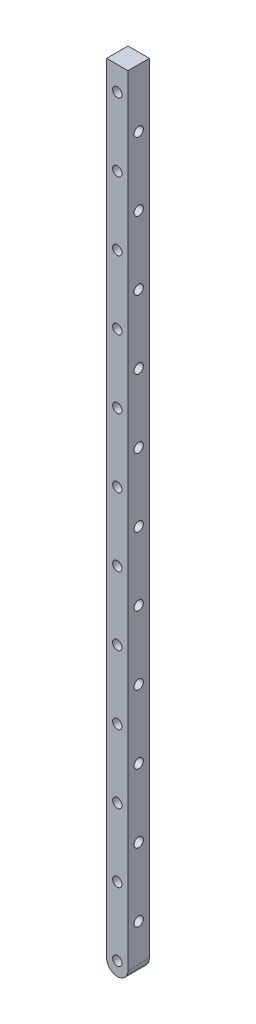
ISO-10303-21;
HEADER;
FILE_DESCRIPTION(('STEP AP214'),'2;1');
FILE_NAME('part.step','',(''),(''),'','','');
FILE_SCHEMA(('AUTOMOTIVE_DESIGN { 1 0 10303 214 1 1 1 1 }'));
ENDSEC;
DATA;
#1=APPLICATION_CONTEXT('core data for automotive mechanical design processes');
#2=APPLICATION_PROTOCOL_DEFINITION('international standard','automotive_design',2000,#1);
#3=PRODUCT_CONTEXT('',#1,'mechanical');
#4=PRODUCT('Part','Part','',(#3));
#5=PRODUCT_RELATED_PRODUCT_CATEGORY('part','',(#4));
#6=PRODUCT_DEFINITION_FORMATION('','',#4);
#7=PRODUCT_DEFINITION_CONTEXT('part definition',#1,'design');
#8=PRODUCT_DEFINITION('design','',#6,#7);
#9=PRODUCT_DEFINITION_SHAPE('','',#8);
#10=(LENGTH_UNIT() NAMED_UNIT(*) SI_UNIT(.MILLI.,.METRE.));
#11=(NAMED_UNIT(*) PLANE_ANGLE_UNIT() SI_UNIT($,.RADIAN.));
#12=(NAMED_UNIT(*) SI_UNIT($,.STERADIAN.) SOLID_ANGLE_UNIT());
#13=UNCERTAINTY_MEASURE_WITH_UNIT(LENGTH_MEASURE(1.E-05),#10,'distance_accuracy_value','');
#14=(GEOMETRIC_REPRESENTATION_CONTEXT(3) GLOBAL_UNCERTAINTY_ASSIGNED_CONTEXT((#13)) GLOBAL_UNIT_ASSIGNED_CONTEXT((#10,
#11,#12)) REPRESENTATION_CONTEXT('',''));
#15=CARTESIAN_POINT('',(0.,0.,0.));
#16=DIRECTION('',(0.,0.,1.));
#17=DIRECTION('',(1.,0.,0.));
#18=AXIS2_PLACEMENT_3D('',#15,#16,#17);
#19=CARTESIAN_POINT('',(0.,-289.40125,3.96874999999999));
#20=DIRECTION('',(0.,0.,1.));
#21=DIRECTION('',(1.,0.,0.));
#22=AXIS2_PLACEMENT_3D('',#19,#20,#21);
#23=CYLINDRICAL_SURFACE('',#22,3.96875000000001);
#24=DIRECTION('',(0.,0.,-1.));
#25=VECTOR('',#24,1.);
#26=CARTESIAN_POINT('',(3.96875,-289.40125,3.96874999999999));
#27=LINE('',#26,#25);
#28=CARTESIAN_POINT('',(3.96875,-289.40125,3.96874999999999));
#29=VERTEX_POINT('',#28);
#30=CARTESIAN_POINT('',(3.96875000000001,-289.40125,-3.96875000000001));
#31=VERTEX_POINT('',#30);
#32=EDGE_CURVE('E173',#29,#31,#27,.T.);
#33=ORIENTED_EDGE('',*,*,#32,.F.);
#34=CARTESIAN_POINT('',(0.,-289.40125,3.96874999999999));
#35=DIRECTION('',(0.,0.,-1.));
#36=DIRECTION('',(-1.,0.,0.));
#37=AXIS2_PLACEMENT_3D('',#34,#35,#36);
#38=CIRCLE('',#37,3.96875000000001);
#39=CARTESIAN_POINT('',(-3.96875,-289.40125,3.96874999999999));
#40=VERTEX_POINT('',#39);
#41=EDGE_CURVE('E46',#40,#29,#38,.F.);
#42=ORIENTED_EDGE('',*,*,#41,.F.);
#43=DIRECTION('',(0.,0.,-1.));
#44=VECTOR('',#43,1.);
#45=CARTESIAN_POINT('',(-3.96875,-289.40125,3.96874999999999));
#46=LINE('',#45,#44);
#47=CARTESIAN_POINT('',(-3.96874999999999,-289.40125,-3.96875000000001));
#48=VERTEX_POINT('',#47);
#49=EDGE_CURVE('E175',#48,#40,#46,.F.);
#50=ORIENTED_EDGE('',*,*,#49,.F.);
#51=CARTESIAN_POINT('',(0.,-289.40125,-3.96875000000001));
#52=DIRECTION('',(0.,0.,1.));
#53=DIRECTION('',(1.,0.,0.));
#54=AXIS2_PLACEMENT_3D('',#51,#52,#53);
#55=CIRCLE('',#54,3.96875000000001);
#56=EDGE_CURVE('E11',#31,#48,#55,.F.);
#57=ORIENTED_EDGE('',*,*,#56,.F.);
#58=EDGE_LOOP('',(#33,#42,#50,#57));
#59=FACE_BOUND('',#58,.T.);
#60=ADVANCED_FACE('F38',(#59),#23,.T.);
#61=CARTESIAN_POINT('',(-3.96875,-293.37,3.96874999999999));
#62=DIRECTION('',(1.,0.,0.));
#63=DIRECTION('',(0.,0.,-1.));
#64=AXIS2_PLACEMENT_3D('',#61,#62,#63);
#65=PLANE('',#64);
#66=CARTESIAN_POINT('',(-3.96874999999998,-275.59,0.));
#67=DIRECTION('',(-1.,0.,0.));
#68=DIRECTION('',(0.,0.,1.));
#69=AXIS2_PLACEMENT_3D('',#66,#67,#68);
#70=CIRCLE('',#69,1.72719999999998);
#71=CARTESIAN_POINT('',(-3.96874999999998,-275.59,1.72719999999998));
#72=VERTEX_POINT('',#71);
#73=EDGE_CURVE('E293',#72,#72,#70,.T.);
#74=ORIENTED_EDGE('',*,*,#73,.F.);
#75=EDGE_LOOP('',(#74));
#76=FACE_BOUND('',#75,.T.);
#77=CARTESIAN_POINT('',(-3.96874999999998,-21.59,0.));
#78=DIRECTION('',(-1.,0.,0.));
#79=DIRECTION('',(0.,0.,1.));
#80=AXIS2_PLACEMENT_3D('',#77,#78,#79);
#81=CIRCLE('',#80,1.72719999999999);
#82=CARTESIAN_POINT('',(-3.96874999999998,-21.59,1.72719999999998));
#83=VERTEX_POINT('',#82);
#84=EDGE_CURVE('E351',#83,#83,#81,.T.);
#85=ORIENTED_EDGE('',*,*,#84,.F.);
#86=EDGE_LOOP('',(#85));
#87=FACE_BOUND('',#86,.T.);
#88=DIRECTION('',(0.,1.,0.));
#89=VECTOR('',#88,1.);
#90=CARTESIAN_POINT('',(-3.96874999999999,-293.37,-3.96875000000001));
#91=LINE('',#90,#89);
#92=CARTESIAN_POINT('',(-3.96874999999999,0.,-3.96875000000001));
#93=VERTEX_POINT('',#92);
#94=EDGE_CURVE('E111',#48,#93,#91,.T.);
#95=ORIENTED_EDGE('',*,*,#94,.F.);
#96=ORIENTED_EDGE('',*,*,#49,.T.);
#97=DIRECTION('',(0.,1.,0.));
#98=VECTOR('',#97,1.);
#99=CARTESIAN_POINT('',(-3.96875,-293.37,3.96874999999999));
#100=LINE('',#99,#98);
#101=CARTESIAN_POINT('',(-3.96875,0.,3.96874999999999));
#102=VERTEX_POINT('',#101);
#103=EDGE_CURVE('E87',#40,#102,#100,.T.);
#104=ORIENTED_EDGE('',*,*,#103,.T.);
#105=DIRECTION('',(0.,0.,-1.));
#106=VECTOR('',#105,1.);
#107=CARTESIAN_POINT('',(-3.96875,0.,3.96874999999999));
#108=LINE('',#107,#106);
#109=EDGE_CURVE('E95',#102,#93,#108,.T.);
#110=ORIENTED_EDGE('',*,*,#109,.T.);
#111=EDGE_LOOP('',(#95,#96,#104,#110));
#112=FACE_BOUND('',#111,.T.);
#113=CARTESIAN_POINT('',(-3.96874999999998,-46.99,0.));
#114=DIRECTION('',(-1.,0.,0.));
#115=DIRECTION('',(0.,0.,1.));
#116=AXIS2_PLACEMENT_3D('',#113,#114,#115);
#117=CIRCLE('',#116,1.72719999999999);
#118=CARTESIAN_POINT('',(-3.96874999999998,-46.99,1.72719999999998));
#119=VERTEX_POINT('',#118);
#120=EDGE_CURVE('E345',#119,#119,#117,.T.);
#121=ORIENTED_EDGE('',*,*,#120,.F.);
#122=EDGE_LOOP('',(#121));
#123=FACE_BOUND('',#122,.T.);
#124=CARTESIAN_POINT('',(-3.96874999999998,-72.39,0.));
#125=DIRECTION('',(-1.,0.,0.));
#126=DIRECTION('',(0.,0.,1.));
#127=AXIS2_PLACEMENT_3D('',#124,#125,#126);
#128=CIRCLE('',#127,1.72719999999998);
#129=CARTESIAN_POINT('',(-3.96874999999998,-72.39,1.72719999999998));
#130=VERTEX_POINT('',#129);
#131=EDGE_CURVE('E339',#130,#130,#128,.T.);
#132=ORIENTED_EDGE('',*,*,#131,.F.);
#133=EDGE_LOOP('',(#132));
#134=FACE_BOUND('',#133,.T.);
#135=CARTESIAN_POINT('',(-3.96874999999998,-97.79,0.));
#136=DIRECTION('',(-1.,0.,0.));
#137=DIRECTION('',(0.,0.,1.));
#138=AXIS2_PLACEMENT_3D('',#135,#136,#137);
#139=CIRCLE('',#138,1.72719999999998);
#140=CARTESIAN_POINT('',(-3.96874999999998,-97.79,1.72719999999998));
#141=VERTEX_POINT('',#140);
#142=EDGE_CURVE('E333',#141,#141,#139,.T.);
#143=ORIENTED_EDGE('',*,*,#142,.F.);
#144=EDGE_LOOP('',(#143));
#145=FACE_BOUND('',#144,.T.);
#146=CARTESIAN_POINT('',(-3.96874999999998,-123.19,0.));
#147=DIRECTION('',(-1.,0.,0.));
#148=DIRECTION('',(0.,0.,1.));
#149=AXIS2_PLACEMENT_3D('',#146,#147,#148);
#150=CIRCLE('',#149,1.72719999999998);
#151=CARTESIAN_POINT('',(-3.96874999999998,-123.19,1.72719999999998));
#152=VERTEX_POINT('',#151);
#153=EDGE_CURVE('E327',#152,#152,#150,.T.);
#154=ORIENTED_EDGE('',*,*,#153,.F.);
#155=EDGE_LOOP('',(#154));
#156=FACE_BOUND('',#155,.T.);
#157=CARTESIAN_POINT('',(-3.96874999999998,-148.59,0.));
#158=DIRECTION('',(-1.,0.,0.));
#159=DIRECTION('',(0.,0.,1.));
#160=AXIS2_PLACEMENT_3D('',#157,#158,#159);
#161=CIRCLE('',#160,1.72719999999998);
#162=CARTESIAN_POINT('',(-3.96874999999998,-148.59,1.72719999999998));
#163=VERTEX_POINT('',#162);
#164=EDGE_CURVE('E321',#163,#163,#161,.T.);
#165=ORIENTED_EDGE('',*,*,#164,.F.);
#166=EDGE_LOOP('',(#165));
#167=FACE_BOUND('',#166,.T.);
#168=CARTESIAN_POINT('',(-3.96874999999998,-173.99,0.));
#169=DIRECTION('',(-1.,0.,0.));
#170=DIRECTION('',(0.,0.,1.));
#171=AXIS2_PLACEMENT_3D('',#168,#169,#170);
#172=CIRCLE('',#171,1.72719999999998);
#173=CARTESIAN_POINT('',(-3.96874999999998,-173.99,1.72719999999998));
#174=VERTEX_POINT('',#173);
#175=EDGE_CURVE('E315',#174,#174,#172,.T.);
#176=ORIENTED_EDGE('',*,*,#175,.F.);
#177=EDGE_LOOP('',(#176));
#178=FACE_BOUND('',#177,.T.);
#179=CARTESIAN_POINT('',(-3.96874999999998,-199.39,0.));
#180=DIRECTION('',(-1.,0.,0.));
#181=DIRECTION('',(0.,0.,1.));
#182=AXIS2_PLACEMENT_3D('',#179,#180,#181);
#183=CIRCLE('',#182,1.72719999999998);
#184=CARTESIAN_POINT('',(-3.96874999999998,-199.39,1.72719999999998));
#185=VERTEX_POINT('',#184);
#186=EDGE_CURVE('E309',#185,#185,#183,.T.);
#187=ORIENTED_EDGE('',*,*,#186,.F.);
#188=EDGE_LOOP('',(#187));
#189=FACE_BOUND('',#188,.T.);
#190=CARTESIAN_POINT('',(-3.96874999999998,-224.79,0.));
#191=DIRECTION('',(-1.,0.,0.));
#192=DIRECTION('',(0.,0.,1.));
#193=AXIS2_PLACEMENT_3D('',#190,#191,#192);
#194=CIRCLE('',#193,1.72719999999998);
#195=CARTESIAN_POINT('',(-3.96874999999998,-224.79,1.72719999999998));
#196=VERTEX_POINT('',#195);
#197=EDGE_CURVE('E303',#196,#196,#194,.T.);
#198=ORIENTED_EDGE('',*,*,#197,.F.);
#199=EDGE_LOOP('',(#198));
#200=FACE_BOUND('',#199,.T.);
#201=CARTESIAN_POINT('',(-3.96874999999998,-250.19,0.));
#202=DIRECTION('',(-1.,0.,0.));
#203=DIRECTION('',(0.,0.,1.));
#204=AXIS2_PLACEMENT_3D('',#201,#202,#203);
#205=CIRCLE('',#204,1.72719999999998);
#206=CARTESIAN_POINT('',(-3.96874999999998,-250.19,1.72719999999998));
#207=VERTEX_POINT('',#206);
#208=EDGE_CURVE('E295',#207,#207,#205,.T.);
#209=ORIENTED_EDGE('',*,*,#208,.F.);
#210=EDGE_LOOP('',(#209));
#211=FACE_BOUND('',#210,.T.);
#212=ADVANCED_FACE('F178',(#76,#87,#112,#123,#134,#145,#156,#167,#178,#189,#200,#211),#65,.F.);
#213=CARTESIAN_POINT('',(3.96875,-293.37,3.96874999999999));
#214=DIRECTION('',(-1.,0.,0.));
#215=DIRECTION('',(0.,0.,1.));
#216=AXIS2_PLACEMENT_3D('',#213,#214,#215);
#217=PLANE('',#216);
#218=CARTESIAN_POINT('',(3.96875000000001,-275.59,0.));
#219=DIRECTION('',(-1.,0.,0.));
#220=DIRECTION('',(0.,0.,1.));
#221=AXIS2_PLACEMENT_3D('',#218,#219,#220);
#222=CIRCLE('',#221,1.72719999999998);
#223=CARTESIAN_POINT('',(3.96875000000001,-275.59,1.72719999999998));
#224=VERTEX_POINT('',#223);
#225=EDGE_CURVE('E291',#224,#224,#222,.T.);
#226=ORIENTED_EDGE('',*,*,#225,.T.);
#227=EDGE_LOOP('',(#226));
#228=FACE_BOUND('',#227,.T.);
#229=CARTESIAN_POINT('',(3.96875000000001,-250.19,0.));
#230=DIRECTION('',(-1.,0.,0.));
#231=DIRECTION('',(0.,0.,1.));
#232=AXIS2_PLACEMENT_3D('',#229,#230,#231);
#233=CIRCLE('',#232,1.72719999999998);
#234=CARTESIAN_POINT('',(3.96875000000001,-250.19,1.72719999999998));
#235=VERTEX_POINT('',#234);
#236=EDGE_CURVE('E300',#235,#235,#233,.T.);
#237=ORIENTED_EDGE('',*,*,#236,.T.);
#238=EDGE_LOOP('',(#237));
#239=FACE_BOUND('',#238,.T.);
#240=CARTESIAN_POINT('',(3.96875000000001,-224.79,0.));
#241=DIRECTION('',(-1.,0.,0.));
#242=DIRECTION('',(0.,0.,1.));
#243=AXIS2_PLACEMENT_3D('',#240,#241,#242);
#244=CIRCLE('',#243,1.72719999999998);
#245=CARTESIAN_POINT('',(3.96875000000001,-224.79,1.72719999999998));
#246=VERTEX_POINT('',#245);
#247=EDGE_CURVE('E306',#246,#246,#244,.T.);
#248=ORIENTED_EDGE('',*,*,#247,.T.);
#249=EDGE_LOOP('',(#248));
#250=FACE_BOUND('',#249,.T.);
#251=CARTESIAN_POINT('',(3.96875000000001,-199.39,0.));
#252=DIRECTION('',(-1.,0.,0.));
#253=DIRECTION('',(0.,0.,1.));
#254=AXIS2_PLACEMENT_3D('',#251,#252,#253);
#255=CIRCLE('',#254,1.72720000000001);
#256=CARTESIAN_POINT('',(3.96875000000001,-199.39,1.7272));
#257=VERTEX_POINT('',#256);
#258=EDGE_CURVE('E312',#257,#257,#255,.T.);
#259=ORIENTED_EDGE('',*,*,#258,.T.);
#260=EDGE_LOOP('',(#259));
#261=FACE_BOUND('',#260,.T.);
#262=CARTESIAN_POINT('',(3.96875000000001,-173.99,0.));
#263=DIRECTION('',(-1.,0.,0.));
#264=DIRECTION('',(0.,0.,1.));
#265=AXIS2_PLACEMENT_3D('',#262,#263,#264);
#266=CIRCLE('',#265,1.72719999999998);
#267=CARTESIAN_POINT('',(3.96875000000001,-173.99,1.72719999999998));
#268=VERTEX_POINT('',#267);
#269=EDGE_CURVE('E318',#268,#268,#266,.T.);
#270=ORIENTED_EDGE('',*,*,#269,.T.);
#271=EDGE_LOOP('',(#270));
#272=FACE_BOUND('',#271,.T.);
#273=CARTESIAN_POINT('',(3.96875000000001,-148.59,0.));
#274=DIRECTION('',(-1.,0.,0.));
#275=DIRECTION('',(0.,0.,1.));
#276=AXIS2_PLACEMENT_3D('',#273,#274,#275);
#277=CIRCLE('',#276,1.72719999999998);
#278=CARTESIAN_POINT('',(3.96875000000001,-148.59,1.72719999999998));
#279=VERTEX_POINT('',#278);
#280=EDGE_CURVE('E324',#279,#279,#277,.T.);
#281=ORIENTED_EDGE('',*,*,#280,.T.);
#282=EDGE_LOOP('',(#281));
#283=FACE_BOUND('',#282,.T.);
#284=CARTESIAN_POINT('',(3.96875000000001,-123.19,0.));
#285=DIRECTION('',(-1.,0.,0.));
#286=DIRECTION('',(0.,0.,1.));
#287=AXIS2_PLACEMENT_3D('',#284,#285,#286);
#288=CIRCLE('',#287,1.7272);
#289=CARTESIAN_POINT('',(3.96875000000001,-123.19,1.72719999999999));
#290=VERTEX_POINT('',#289);
#291=EDGE_CURVE('E330',#290,#290,#288,.T.);
#292=ORIENTED_EDGE('',*,*,#291,.T.);
#293=EDGE_LOOP('',(#292));
#294=FACE_BOUND('',#293,.T.);
#295=CARTESIAN_POINT('',(3.96875000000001,-97.79,0.));
#296=DIRECTION('',(-1.,0.,0.));
#297=DIRECTION('',(0.,0.,1.));
#298=AXIS2_PLACEMENT_3D('',#295,#296,#297);
#299=CIRCLE('',#298,1.7272);
#300=CARTESIAN_POINT('',(3.96875000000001,-97.79,1.72719999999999));
#301=VERTEX_POINT('',#300);
#302=EDGE_CURVE('E336',#301,#301,#299,.T.);
#303=ORIENTED_EDGE('',*,*,#302,.T.);
#304=EDGE_LOOP('',(#303));
#305=FACE_BOUND('',#304,.T.);
#306=CARTESIAN_POINT('',(3.96875000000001,-72.39,0.));
#307=DIRECTION('',(-1.,0.,0.));
#308=DIRECTION('',(0.,0.,1.));
#309=AXIS2_PLACEMENT_3D('',#306,#307,#308);
#310=CIRCLE('',#309,1.7272);
#311=CARTESIAN_POINT('',(3.96875000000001,-72.39,1.72719999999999));
#312=VERTEX_POINT('',#311);
#313=EDGE_CURVE('E342',#312,#312,#310,.T.);
#314=ORIENTED_EDGE('',*,*,#313,.T.);
#315=EDGE_LOOP('',(#314));
#316=FACE_BOUND('',#315,.T.);
#317=CARTESIAN_POINT('',(3.96875000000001,-46.99,0.));
#318=DIRECTION('',(-1.,0.,0.));
#319=DIRECTION('',(0.,0.,1.));
#320=AXIS2_PLACEMENT_3D('',#317,#318,#319);
#321=CIRCLE('',#320,1.7272);
#322=CARTESIAN_POINT('',(3.96875000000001,-46.99,1.72719999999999));
#323=VERTEX_POINT('',#322);
#324=EDGE_CURVE('E348',#323,#323,#321,.T.);
#325=ORIENTED_EDGE('',*,*,#324,.T.);
#326=EDGE_LOOP('',(#325));
#327=FACE_BOUND('',#326,.T.);
#328=CARTESIAN_POINT('',(3.96875000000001,-21.59,0.));
#329=DIRECTION('',(-1.,0.,0.));
#330=DIRECTION('',(0.,0.,1.));
#331=AXIS2_PLACEMENT_3D('',#328,#329,#330);
#332=CIRCLE('',#331,1.7272);
#333=CARTESIAN_POINT('',(3.96875000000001,-21.59,1.72719999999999));
#334=VERTEX_POINT('',#333);
#335=EDGE_CURVE('E354',#334,#334,#332,.T.);
#336=ORIENTED_EDGE('',*,*,#335,.T.);
#337=EDGE_LOOP('',(#336));
#338=FACE_BOUND('',#337,.T.);
#339=DIRECTION('',(0.,1.,0.));
#340=VECTOR('',#339,1.);
#341=CARTESIAN_POINT('',(3.96875,-293.37,3.96874999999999));
#342=LINE('',#341,#340);
#343=CARTESIAN_POINT('',(3.96875,0.,3.96874999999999));
#344=VERTEX_POINT('',#343);
#345=EDGE_CURVE('E76',#29,#344,#342,.T.);
#346=ORIENTED_EDGE('',*,*,#345,.F.);
#347=ORIENTED_EDGE('',*,*,#32,.T.);
#348=DIRECTION('',(0.,1.,0.));
#349=VECTOR('',#348,1.);
#350=CARTESIAN_POINT('',(3.96875000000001,-293.37,-3.96875000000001));
#351=LINE('',#350,#349);
#352=CARTESIAN_POINT('',(3.96875000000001,0.,-3.96875000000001));
#353=VERTEX_POINT('',#352);
#354=EDGE_CURVE('E98',#31,#353,#351,.T.);
#355=ORIENTED_EDGE('',*,*,#354,.T.);
#356=DIRECTION('',(0.,0.,1.));
#357=VECTOR('',#356,1.);
#358=CARTESIAN_POINT('',(3.96875,0.,3.96874999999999));
#359=LINE('',#358,#357);
#360=EDGE_CURVE('E93',#353,#344,#359,.T.);
#361=ORIENTED_EDGE('',*,*,#360,.T.);
#362=EDGE_LOOP('',(#346,#347,#355,#361));
#363=FACE_BOUND('',#362,.T.);
#364=ADVANCED_FACE('F97',(#228,#239,#250,#261,#272,#283,#294,#305,#316,#327,#338,#363),#217,.F.);
#365=CARTESIAN_POINT('',(-3.96875,-293.37,3.96874999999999));
#366=DIRECTION('',(0.,0.,-1.));
#367=DIRECTION('',(-1.,0.,0.));
#368=AXIS2_PLACEMENT_3D('',#365,#366,#367);
#369=PLANE('',#368);
#370=CARTESIAN_POINT('',(0.,-34.29,3.96874999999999));
#371=DIRECTION('',(0.,0.,1.));
#372=DIRECTION('',(1.,0.,0.));
#373=AXIS2_PLACEMENT_3D('',#370,#371,#372);
#374=CIRCLE('',#373,1.72719999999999);
#375=CARTESIAN_POINT('',(1.72719999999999,-34.29,3.96874999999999));
#376=VERTEX_POINT('',#375);
#377=EDGE_CURVE('E360',#376,#376,#374,.T.);
#378=ORIENTED_EDGE('',*,*,#377,.F.);
#379=EDGE_LOOP('',(#378));
#380=FACE_BOUND('',#379,.T.);
#381=CARTESIAN_POINT('',(0.,-8.89,3.96874999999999));
#382=DIRECTION('',(0.,0.,1.));
#383=DIRECTION('',(1.,0.,0.));
#384=AXIS2_PLACEMENT_3D('',#381,#382,#383);
#385=CIRCLE('',#384,1.72719999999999);
#386=CARTESIAN_POINT('',(1.72719999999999,-8.89,3.96874999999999));
#387=VERTEX_POINT('',#386);
#388=EDGE_CURVE('E103',#387,#387,#385,.T.);
#389=ORIENTED_EDGE('',*,*,#388,.F.);
#390=EDGE_LOOP('',(#389));
#391=FACE_BOUND('',#390,.T.);
#392=ORIENTED_EDGE('',*,*,#103,.F.);
#393=ORIENTED_EDGE('',*,*,#41,.T.);
#394=ORIENTED_EDGE('',*,*,#345,.T.);
#395=DIRECTION('',(-1.,0.,0.));
#396=VECTOR('',#395,1.);
#397=CARTESIAN_POINT('',(-3.96875,0.,3.96874999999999));
#398=LINE('',#397,#396);
#399=EDGE_CURVE('E81',#344,#102,#398,.T.);
#400=ORIENTED_EDGE('',*,*,#399,.T.);
#401=EDGE_LOOP('',(#392,#393,#394,#400));
#402=FACE_BOUND('',#401,.T.);
#403=CARTESIAN_POINT('',(0.,-59.69,3.96874999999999));
#404=DIRECTION('',(0.,0.,1.));
#405=DIRECTION('',(1.,0.,0.));
#406=AXIS2_PLACEMENT_3D('',#403,#404,#405);
#407=CIRCLE('',#406,1.72719999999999);
#408=CARTESIAN_POINT('',(1.72719999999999,-59.69,3.96874999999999));
#409=VERTEX_POINT('',#408);
#410=EDGE_CURVE('E116',#409,#409,#407,.T.);
#411=ORIENTED_EDGE('',*,*,#410,.F.);
#412=EDGE_LOOP('',(#411));
#413=FACE_BOUND('',#412,.T.);
#414=CARTESIAN_POINT('',(0.,-85.09,3.96874999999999));
#415=DIRECTION('',(0.,0.,1.));
#416=DIRECTION('',(1.,0.,0.));
#417=AXIS2_PLACEMENT_3D('',#414,#415,#416);
#418=CIRCLE('',#417,1.72719999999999);
#419=CARTESIAN_POINT('',(1.72719999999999,-85.09,3.96874999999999));
#420=VERTEX_POINT('',#419);
#421=EDGE_CURVE('E122',#420,#420,#418,.T.);
#422=ORIENTED_EDGE('',*,*,#421,.F.);
#423=EDGE_LOOP('',(#422));
#424=FACE_BOUND('',#423,.T.);
#425=CARTESIAN_POINT('',(0.,-110.49,3.96874999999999));
#426=DIRECTION('',(0.,0.,1.));
#427=DIRECTION('',(1.,0.,0.));
#428=AXIS2_PLACEMENT_3D('',#425,#426,#427);
#429=CIRCLE('',#428,1.72719999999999);
#430=CARTESIAN_POINT('',(1.72719999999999,-110.49,3.96874999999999));
#431=VERTEX_POINT('',#430);
#432=EDGE_CURVE('E128',#431,#431,#429,.T.);
#433=ORIENTED_EDGE('',*,*,#432,.F.);
#434=EDGE_LOOP('',(#433));
#435=FACE_BOUND('',#434,.T.);
#436=CARTESIAN_POINT('',(0.,-135.89,3.96874999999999));
#437=DIRECTION('',(0.,0.,1.));
#438=DIRECTION('',(1.,0.,0.));
#439=AXIS2_PLACEMENT_3D('',#436,#437,#438);
#440=CIRCLE('',#439,1.72719999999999);
#441=CARTESIAN_POINT('',(1.72719999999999,-135.89,3.96874999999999));
#442=VERTEX_POINT('',#441);
#443=EDGE_CURVE('E134',#442,#442,#440,.T.);
#444=ORIENTED_EDGE('',*,*,#443,.F.);
#445=EDGE_LOOP('',(#444));
#446=FACE_BOUND('',#445,.T.);
#447=CARTESIAN_POINT('',(0.,-161.29,3.96874999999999));
#448=DIRECTION('',(0.,0.,1.));
#449=DIRECTION('',(1.,0.,0.));
#450=AXIS2_PLACEMENT_3D('',#447,#448,#449);
#451=CIRCLE('',#450,1.72719999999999);
#452=CARTESIAN_POINT('',(1.72719999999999,-161.29,3.96874999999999));
#453=VERTEX_POINT('',#452);
#454=EDGE_CURVE('E140',#453,#453,#451,.T.);
#455=ORIENTED_EDGE('',*,*,#454,.F.);
#456=EDGE_LOOP('',(#455));
#457=FACE_BOUND('',#456,.T.);
#458=CARTESIAN_POINT('',(0.,-186.69,3.96874999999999));
#459=DIRECTION('',(0.,0.,1.));
#460=DIRECTION('',(1.,0.,0.));
#461=AXIS2_PLACEMENT_3D('',#458,#459,#460);
#462=CIRCLE('',#461,1.72719999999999);
#463=CARTESIAN_POINT('',(1.72719999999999,-186.69,3.96874999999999));
#464=VERTEX_POINT('',#463);
#465=EDGE_CURVE('E146',#464,#464,#462,.T.);
#466=ORIENTED_EDGE('',*,*,#465,.F.);
#467=EDGE_LOOP('',(#466));
#468=FACE_BOUND('',#467,.T.);
#469=CARTESIAN_POINT('',(0.,-212.09,3.96874999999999));
#470=DIRECTION('',(0.,0.,1.));
#471=DIRECTION('',(1.,0.,0.));
#472=AXIS2_PLACEMENT_3D('',#469,#470,#471);
#473=CIRCLE('',#472,1.72719999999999);
#474=CARTESIAN_POINT('',(1.72719999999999,-212.09,3.96874999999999));
#475=VERTEX_POINT('',#474);
#476=EDGE_CURVE('E152',#475,#475,#473,.T.);
#477=ORIENTED_EDGE('',*,*,#476,.F.);
#478=EDGE_LOOP('',(#477));
#479=FACE_BOUND('',#478,.T.);
#480=CARTESIAN_POINT('',(0.,-237.49,3.96874999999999));
#481=DIRECTION('',(0.,0.,1.));
#482=DIRECTION('',(1.,0.,0.));
#483=AXIS2_PLACEMENT_3D('',#480,#481,#482);
#484=CIRCLE('',#483,1.72719999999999);
#485=CARTESIAN_POINT('',(1.72719999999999,-237.49,3.96874999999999));
#486=VERTEX_POINT('',#485);
#487=EDGE_CURVE('E158',#486,#486,#484,.T.);
#488=ORIENTED_EDGE('',*,*,#487,.F.);
#489=EDGE_LOOP('',(#488));
#490=FACE_BOUND('',#489,.T.);
#491=CARTESIAN_POINT('',(0.,-262.89,3.96874999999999));
#492=DIRECTION('',(0.,0.,1.));
#493=DIRECTION('',(1.,0.,0.));
#494=AXIS2_PLACEMENT_3D('',#491,#492,#493);
#495=CIRCLE('',#494,1.72719999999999);
#496=CARTESIAN_POINT('',(1.72719999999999,-262.89,3.96874999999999));
#497=VERTEX_POINT('',#496);
#498=EDGE_CURVE('E164',#497,#497,#495,.T.);
#499=ORIENTED_EDGE('',*,*,#498,.F.);
#500=EDGE_LOOP('',(#499));
#501=FACE_BOUND('',#500,.T.);
#502=CARTESIAN_POINT('',(0.,-288.29,3.96874999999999));
#503=DIRECTION('',(0.,0.,1.));
#504=DIRECTION('',(1.,0.,0.));
#505=AXIS2_PLACEMENT_3D('',#502,#503,#504);
#506=CIRCLE('',#505,1.72719999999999);
#507=CARTESIAN_POINT('',(1.72719999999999,-288.29,3.96874999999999));
#508=VERTEX_POINT('',#507);
#509=EDGE_CURVE('E170',#508,#508,#506,.T.);
#510=ORIENTED_EDGE('',*,*,#509,.F.);
#511=EDGE_LOOP('',(#510));
#512=FACE_BOUND('',#511,.T.);
#513=ADVANCED_FACE('F79',(#380,#391,#402,#413,#424,#435,#446,#457,#468,#479,#490,#501,#512),
#369,.F.);
#514=CARTESIAN_POINT('',(-3.96874999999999,-293.37,-3.96875000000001));
#515=DIRECTION('',(0.,0.,1.));
#516=DIRECTION('',(1.,0.,0.));
#517=AXIS2_PLACEMENT_3D('',#514,#515,#516);
#518=PLANE('',#517);
#519=CARTESIAN_POINT('',(0.,-34.29,-3.96875000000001));
#520=DIRECTION('',(0.,0.,1.));
#521=DIRECTION('',(1.,0.,0.));
#522=AXIS2_PLACEMENT_3D('',#519,#520,#521);
#523=CIRCLE('',#522,1.7272);
#524=CARTESIAN_POINT('',(1.7272,-34.29,-3.96875000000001));
#525=VERTEX_POINT('',#524);
#526=EDGE_CURVE('E357',#525,#525,#523,.T.);
#527=ORIENTED_EDGE('',*,*,#526,.T.);
#528=EDGE_LOOP('',(#527));
#529=FACE_BOUND('',#528,.T.);
#530=CARTESIAN_POINT('',(0.,-8.89,-3.96875000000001));
#531=DIRECTION('',(0.,0.,1.));
#532=DIRECTION('',(1.,0.,0.));
#533=AXIS2_PLACEMENT_3D('',#530,#531,#532);
#534=CIRCLE('',#533,1.7272);
#535=CARTESIAN_POINT('',(1.7272,-8.89,-3.96875000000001));
#536=VERTEX_POINT('',#535);
#537=EDGE_CURVE('E100',#536,#536,#534,.T.);
#538=ORIENTED_EDGE('',*,*,#537,.T.);
#539=EDGE_LOOP('',(#538));
#540=FACE_BOUND('',#539,.T.);
#541=ORIENTED_EDGE('',*,*,#354,.F.);
#542=ORIENTED_EDGE('',*,*,#56,.T.);
#543=ORIENTED_EDGE('',*,*,#94,.T.);
#544=DIRECTION('',(1.,0.,0.));
#545=VECTOR('',#544,1.);
#546=CARTESIAN_POINT('',(-3.96874999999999,0.,-3.96875000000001));
#547=LINE('',#546,#545);
#548=EDGE_CURVE('E108',#93,#353,#547,.T.);
#549=ORIENTED_EDGE('',*,*,#548,.T.);
#550=EDGE_LOOP('',(#541,#542,#543,#549));
#551=FACE_BOUND('',#550,.T.);
#552=CARTESIAN_POINT('',(0.,-59.69,-3.96875000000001));
#553=DIRECTION('',(0.,0.,1.));
#554=DIRECTION('',(1.,0.,0.));
#555=AXIS2_PLACEMENT_3D('',#552,#553,#554);
#556=CIRCLE('',#555,1.7272);
#557=CARTESIAN_POINT('',(1.7272,-59.69,-3.96875000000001));
#558=VERTEX_POINT('',#557);
#559=EDGE_CURVE('E86',#558,#558,#556,.T.);
#560=ORIENTED_EDGE('',*,*,#559,.T.);
#561=EDGE_LOOP('',(#560));
#562=FACE_BOUND('',#561,.T.);
#563=CARTESIAN_POINT('',(0.,-85.09,-3.96875000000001));
#564=DIRECTION('',(0.,0.,1.));
#565=DIRECTION('',(1.,0.,0.));
#566=AXIS2_PLACEMENT_3D('',#563,#564,#565);
#567=CIRCLE('',#566,1.7272);
#568=CARTESIAN_POINT('',(1.7272,-85.09,-3.96875000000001));
#569=VERTEX_POINT('',#568);
#570=EDGE_CURVE('E119',#569,#569,#567,.T.);
#571=ORIENTED_EDGE('',*,*,#570,.T.);
#572=EDGE_LOOP('',(#571));
#573=FACE_BOUND('',#572,.T.);
#574=CARTESIAN_POINT('',(0.,-110.49,-3.96875000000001));
#575=DIRECTION('',(0.,0.,1.));
#576=DIRECTION('',(1.,0.,0.));
#577=AXIS2_PLACEMENT_3D('',#574,#575,#576);
#578=CIRCLE('',#577,1.7272);
#579=CARTESIAN_POINT('',(1.7272,-110.49,-3.96875000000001));
#580=VERTEX_POINT('',#579);
#581=EDGE_CURVE('E125',#580,#580,#578,.T.);
#582=ORIENTED_EDGE('',*,*,#581,.T.);
#583=EDGE_LOOP('',(#582));
#584=FACE_BOUND('',#583,.T.);
#585=CARTESIAN_POINT('',(0.,-135.89,-3.96875000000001));
#586=DIRECTION('',(0.,0.,1.));
#587=DIRECTION('',(1.,0.,0.));
#588=AXIS2_PLACEMENT_3D('',#585,#586,#587);
#589=CIRCLE('',#588,1.7272);
#590=CARTESIAN_POINT('',(1.7272,-135.89,-3.96875000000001));
#591=VERTEX_POINT('',#590);
#592=EDGE_CURVE('E131',#591,#591,#589,.T.);
#593=ORIENTED_EDGE('',*,*,#592,.T.);
#594=EDGE_LOOP('',(#593));
#595=FACE_BOUND('',#594,.T.);
#596=CARTESIAN_POINT('',(0.,-161.29,-3.96875000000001));
#597=DIRECTION('',(0.,0.,1.));
#598=DIRECTION('',(1.,0.,0.));
#599=AXIS2_PLACEMENT_3D('',#596,#597,#598);
#600=CIRCLE('',#599,1.7272);
#601=CARTESIAN_POINT('',(1.7272,-161.29,-3.96875000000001));
#602=VERTEX_POINT('',#601);
#603=EDGE_CURVE('E137',#602,#602,#600,.T.);
#604=ORIENTED_EDGE('',*,*,#603,.T.);
#605=EDGE_LOOP('',(#604));
#606=FACE_BOUND('',#605,.T.);
#607=CARTESIAN_POINT('',(0.,-186.69,-3.96875000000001));
#608=DIRECTION('',(0.,0.,1.));
#609=DIRECTION('',(1.,0.,0.));
#610=AXIS2_PLACEMENT_3D('',#607,#608,#609);
#611=CIRCLE('',#610,1.7272);
#612=CARTESIAN_POINT('',(1.7272,-186.69,-3.96875000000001));
#613=VERTEX_POINT('',#612);
#614=EDGE_CURVE('E143',#613,#613,#611,.T.);
#615=ORIENTED_EDGE('',*,*,#614,.T.);
#616=EDGE_LOOP('',(#615));
#617=FACE_BOUND('',#616,.T.);
#618=CARTESIAN_POINT('',(0.,-212.09,-3.96875000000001));
#619=DIRECTION('',(0.,0.,1.));
#620=DIRECTION('',(1.,0.,0.));
#621=AXIS2_PLACEMENT_3D('',#618,#619,#620);
#622=CIRCLE('',#621,1.7272);
#623=CARTESIAN_POINT('',(1.7272,-212.09,-3.96875000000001));
#624=VERTEX_POINT('',#623);
#625=EDGE_CURVE('E149',#624,#624,#622,.T.);
#626=ORIENTED_EDGE('',*,*,#625,.T.);
#627=EDGE_LOOP('',(#626));
#628=FACE_BOUND('',#627,.T.);
#629=CARTESIAN_POINT('',(0.,-237.49,-3.96875000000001));
#630=DIRECTION('',(0.,0.,1.));
#631=DIRECTION('',(1.,0.,0.));
#632=AXIS2_PLACEMENT_3D('',#629,#630,#631);
#633=CIRCLE('',#632,1.7272);
#634=CARTESIAN_POINT('',(1.7272,-237.49,-3.96875000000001));
#635=VERTEX_POINT('',#634);
#636=EDGE_CURVE('E155',#635,#635,#633,.T.);
#637=ORIENTED_EDGE('',*,*,#636,.T.);
#638=EDGE_LOOP('',(#637));
#639=FACE_BOUND('',#638,.T.);
#640=CARTESIAN_POINT('',(0.,-262.89,-3.96875000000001));
#641=DIRECTION('',(0.,0.,1.));
#642=DIRECTION('',(1.,0.,0.));
#643=AXIS2_PLACEMENT_3D('',#640,#641,#642);
#644=CIRCLE('',#643,1.7272);
#645=CARTESIAN_POINT('',(1.7272,-262.89,-3.96875000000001));
#646=VERTEX_POINT('',#645);
#647=EDGE_CURVE('E161',#646,#646,#644,.T.);
#648=ORIENTED_EDGE('',*,*,#647,.T.);
#649=EDGE_LOOP('',(#648));
#650=FACE_BOUND('',#649,.T.);
#651=CARTESIAN_POINT('',(0.,-288.29,-3.96875000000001));
#652=DIRECTION('',(0.,0.,1.));
#653=DIRECTION('',(1.,0.,0.));
#654=AXIS2_PLACEMENT_3D('',#651,#652,#653);
#655=CIRCLE('',#654,1.7272);
#656=CARTESIAN_POINT('',(1.7272,-288.29,-3.96875000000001));
#657=VERTEX_POINT('',#656);
#658=EDGE_CURVE('E167',#657,#657,#655,.T.);
#659=ORIENTED_EDGE('',*,*,#658,.T.);
#660=EDGE_LOOP('',(#659));
#661=FACE_BOUND('',#660,.T.);
#662=ADVANCED_FACE('F180',(#529,#540,#551,#562,#573,#584,#595,#606,#617,#628,#639,#650,#661),
#518,.F.);
#663=CARTESIAN_POINT('',(0.,0.,0.));
#664=DIRECTION('',(0.,-1.,0.));
#665=DIRECTION('',(0.,0.,-1.));
#666=AXIS2_PLACEMENT_3D('',#663,#664,#665);
#667=PLANE('',#666);
#668=ORIENTED_EDGE('',*,*,#360,.F.);
#669=ORIENTED_EDGE('',*,*,#548,.F.);
#670=ORIENTED_EDGE('',*,*,#109,.F.);
#671=ORIENTED_EDGE('',*,*,#399,.F.);
#672=EDGE_LOOP('',(#668,#669,#670,#671));
#673=FACE_BOUND('',#672,.T.);
#674=ADVANCED_FACE('F91',(#673),#667,.F.);
#675=CARTESIAN_POINT('',(0.,-8.89,3.96874999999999));
#676=DIRECTION('',(0.,0.,1.));
#677=DIRECTION('',(1.,0.,0.));
#678=AXIS2_PLACEMENT_3D('',#675,#676,#677);
#679=CYLINDRICAL_SURFACE('',#678,1.72719999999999);
#680=ORIENTED_EDGE('',*,*,#537,.F.);
#681=EDGE_LOOP('',(#680));
#682=FACE_BOUND('',#681,.T.);
#683=ORIENTED_EDGE('',*,*,#388,.T.);
#684=EDGE_LOOP('',(#683));
#685=FACE_BOUND('',#684,.T.);
#686=ADVANCED_FACE('F235',(#682,#685),#679,.F.);
#687=CARTESIAN_POINT('',(0.,-34.29,3.96874999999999));
#688=DIRECTION('',(0.,0.,1.));
#689=DIRECTION('',(1.,0.,0.));
#690=AXIS2_PLACEMENT_3D('',#687,#688,#689);
#691=CYLINDRICAL_SURFACE('',#690,1.72719999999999);
#692=ORIENTED_EDGE('',*,*,#526,.F.);
#693=EDGE_LOOP('',(#692));
#694=FACE_BOUND('',#693,.T.);
#695=ORIENTED_EDGE('',*,*,#377,.T.);
#696=EDGE_LOOP('',(#695));
#697=FACE_BOUND('',#696,.T.);
#698=ADVANCED_FACE('F238',(#694,#697),#691,.F.);
#699=CARTESIAN_POINT('',(0.,-59.69,3.96874999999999));
#700=DIRECTION('',(0.,0.,1.));
#701=DIRECTION('',(1.,0.,0.));
#702=AXIS2_PLACEMENT_3D('',#699,#700,#701);
#703=CYLINDRICAL_SURFACE('',#702,1.72719999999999);
#704=ORIENTED_EDGE('',*,*,#559,.F.);
#705=EDGE_LOOP('',(#704));
#706=FACE_BOUND('',#705,.T.);
#707=ORIENTED_EDGE('',*,*,#410,.T.);
#708=EDGE_LOOP('',(#707));
#709=FACE_BOUND('',#708,.T.);
#710=ADVANCED_FACE('F242',(#706,#709),#703,.F.);
#711=CARTESIAN_POINT('',(0.,-85.09,3.96874999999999));
#712=DIRECTION('',(0.,0.,1.));
#713=DIRECTION('',(1.,0.,0.));
#714=AXIS2_PLACEMENT_3D('',#711,#712,#713);
#715=CYLINDRICAL_SURFACE('',#714,1.72719999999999);
#716=ORIENTED_EDGE('',*,*,#570,.F.);
#717=EDGE_LOOP('',(#716));
#718=FACE_BOUND('',#717,.T.);
#719=ORIENTED_EDGE('',*,*,#421,.T.);
#720=EDGE_LOOP('',(#719));
#721=FACE_BOUND('',#720,.T.);
#722=ADVANCED_FACE('F519',(#718,#721),#715,.F.);
#723=CARTESIAN_POINT('',(0.,-110.49,3.96874999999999));
#724=DIRECTION('',(0.,0.,1.));
#725=DIRECTION('',(1.,0.,0.));
#726=AXIS2_PLACEMENT_3D('',#723,#724,#725);
#727=CYLINDRICAL_SURFACE('',#726,1.72719999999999);
#728=ORIENTED_EDGE('',*,*,#581,.F.);
#729=EDGE_LOOP('',(#728));
#730=FACE_BOUND('',#729,.T.);
#731=ORIENTED_EDGE('',*,*,#432,.T.);
#732=EDGE_LOOP('',(#731));
#733=FACE_BOUND('',#732,.T.);
#734=ADVANCED_FACE('F512',(#730,#733),#727,.F.);
#735=CARTESIAN_POINT('',(0.,-135.89,3.96874999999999));
#736=DIRECTION('',(0.,0.,1.));
#737=DIRECTION('',(1.,0.,0.));
#738=AXIS2_PLACEMENT_3D('',#735,#736,#737);
#739=CYLINDRICAL_SURFACE('',#738,1.72719999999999);
#740=ORIENTED_EDGE('',*,*,#592,.F.);
#741=EDGE_LOOP('',(#740));
#742=FACE_BOUND('',#741,.T.);
#743=ORIENTED_EDGE('',*,*,#443,.T.);
#744=EDGE_LOOP('',(#743));
#745=FACE_BOUND('',#744,.T.);
#746=ADVANCED_FACE('F505',(#742,#745),#739,.F.);
#747=CARTESIAN_POINT('',(0.,-161.29,3.96874999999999));
#748=DIRECTION('',(0.,0.,1.));
#749=DIRECTION('',(1.,0.,0.));
#750=AXIS2_PLACEMENT_3D('',#747,#748,#749);
#751=CYLINDRICAL_SURFACE('',#750,1.72719999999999);
#752=ORIENTED_EDGE('',*,*,#603,.F.);
#753=EDGE_LOOP('',(#752));
#754=FACE_BOUND('',#753,.T.);
#755=ORIENTED_EDGE('',*,*,#454,.T.);
#756=EDGE_LOOP('',(#755));
#757=FACE_BOUND('',#756,.T.);
#758=ADVANCED_FACE('F498',(#754,#757),#751,.F.);
#759=CARTESIAN_POINT('',(0.,-186.69,3.96874999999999));
#760=DIRECTION('',(0.,0.,1.));
#761=DIRECTION('',(1.,0.,0.));
#762=AXIS2_PLACEMENT_3D('',#759,#760,#761);
#763=CYLINDRICAL_SURFACE('',#762,1.72719999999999);
#764=ORIENTED_EDGE('',*,*,#614,.F.);
#765=EDGE_LOOP('',(#764));
#766=FACE_BOUND('',#765,.T.);
#767=ORIENTED_EDGE('',*,*,#465,.T.);
#768=EDGE_LOOP('',(#767));
#769=FACE_BOUND('',#768,.T.);
#770=ADVANCED_FACE('F491',(#766,#769),#763,.F.);
#771=CARTESIAN_POINT('',(0.,-212.09,3.96874999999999));
#772=DIRECTION('',(0.,0.,1.));
#773=DIRECTION('',(1.,0.,0.));
#774=AXIS2_PLACEMENT_3D('',#771,#772,#773);
#775=CYLINDRICAL_SURFACE('',#774,1.72719999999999);
#776=ORIENTED_EDGE('',*,*,#625,.F.);
#777=EDGE_LOOP('',(#776));
#778=FACE_BOUND('',#777,.T.);
#779=ORIENTED_EDGE('',*,*,#476,.T.);
#780=EDGE_LOOP('',(#779));
#781=FACE_BOUND('',#780,.T.);
#782=ADVANCED_FACE('F481',(#778,#781),#775,.F.);
#783=CARTESIAN_POINT('',(0.,-237.49,3.96874999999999));
#784=DIRECTION('',(0.,0.,1.));
#785=DIRECTION('',(1.,0.,0.));
#786=AXIS2_PLACEMENT_3D('',#783,#784,#785);
#787=CYLINDRICAL_SURFACE('',#786,1.72719999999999);
#788=ORIENTED_EDGE('',*,*,#636,.F.);
#789=EDGE_LOOP('',(#788));
#790=FACE_BOUND('',#789,.T.);
#791=ORIENTED_EDGE('',*,*,#487,.T.);
#792=EDGE_LOOP('',(#791));
#793=FACE_BOUND('',#792,.T.);
#794=ADVANCED_FACE('F472',(#790,#793),#787,.F.);
#795=CARTESIAN_POINT('',(0.,-262.89,3.96874999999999));
#796=DIRECTION('',(0.,0.,1.));
#797=DIRECTION('',(1.,0.,0.));
#798=AXIS2_PLACEMENT_3D('',#795,#796,#797);
#799=CYLINDRICAL_SURFACE('',#798,1.72719999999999);
#800=ORIENTED_EDGE('',*,*,#647,.F.);
#801=EDGE_LOOP('',(#800));
#802=FACE_BOUND('',#801,.T.);
#803=ORIENTED_EDGE('',*,*,#498,.T.);
#804=EDGE_LOOP('',(#803));
#805=FACE_BOUND('',#804,.T.);
#806=ADVANCED_FACE('F209',(#802,#805),#799,.F.);
#807=CARTESIAN_POINT('',(0.,-288.29,3.96874999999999));
#808=DIRECTION('',(0.,0.,1.));
#809=DIRECTION('',(1.,0.,0.));
#810=AXIS2_PLACEMENT_3D('',#807,#808,#809);
#811=CYLINDRICAL_SURFACE('',#810,1.72719999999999);
#812=ORIENTED_EDGE('',*,*,#658,.F.);
#813=EDGE_LOOP('',(#812));
#814=FACE_BOUND('',#813,.T.);
#815=ORIENTED_EDGE('',*,*,#509,.T.);
#816=EDGE_LOOP('',(#815));
#817=FACE_BOUND('',#816,.T.);
#818=ADVANCED_FACE('F205',(#814,#817),#811,.F.);
#819=CARTESIAN_POINT('',(-3.96874999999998,-21.59,0.));
#820=DIRECTION('',(-1.,0.,0.));
#821=DIRECTION('',(0.,0.,1.));
#822=AXIS2_PLACEMENT_3D('',#819,#820,#821);
#823=CYLINDRICAL_SURFACE('',#822,1.72719999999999);
#824=ORIENTED_EDGE('',*,*,#335,.F.);
#825=EDGE_LOOP('',(#824));
#826=FACE_BOUND('',#825,.T.);
#827=ORIENTED_EDGE('',*,*,#84,.T.);
#828=EDGE_LOOP('',(#827));
#829=FACE_BOUND('',#828,.T.);
#830=ADVANCED_FACE('F208',(#826,#829),#823,.F.);
#831=CARTESIAN_POINT('',(-3.96874999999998,-46.99,0.));
#832=DIRECTION('',(-1.,0.,0.));
#833=DIRECTION('',(0.,0.,1.));
#834=AXIS2_PLACEMENT_3D('',#831,#832,#833);
#835=CYLINDRICAL_SURFACE('',#834,1.72719999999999);
#836=ORIENTED_EDGE('',*,*,#324,.F.);
#837=EDGE_LOOP('',(#836));
#838=FACE_BOUND('',#837,.T.);
#839=ORIENTED_EDGE('',*,*,#120,.T.);
#840=EDGE_LOOP('',(#839));
#841=FACE_BOUND('',#840,.T.);
#842=ADVANCED_FACE('F246',(#838,#841),#835,.F.);
#843=CARTESIAN_POINT('',(-3.96874999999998,-72.39,0.));
#844=DIRECTION('',(-1.,0.,0.));
#845=DIRECTION('',(0.,0.,1.));
#846=AXIS2_PLACEMENT_3D('',#843,#844,#845);
#847=CYLINDRICAL_SURFACE('',#846,1.72719999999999);
#848=ORIENTED_EDGE('',*,*,#313,.F.);
#849=EDGE_LOOP('',(#848));
#850=FACE_BOUND('',#849,.T.);
#851=ORIENTED_EDGE('',*,*,#131,.T.);
#852=EDGE_LOOP('',(#851));
#853=FACE_BOUND('',#852,.T.);
#854=ADVANCED_FACE('F250',(#850,#853),#847,.F.);
#855=CARTESIAN_POINT('',(-3.96874999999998,-97.79,0.));
#856=DIRECTION('',(-1.,0.,0.));
#857=DIRECTION('',(0.,0.,1.));
#858=AXIS2_PLACEMENT_3D('',#855,#856,#857);
#859=CYLINDRICAL_SURFACE('',#858,1.72719999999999);
#860=ORIENTED_EDGE('',*,*,#302,.F.);
#861=EDGE_LOOP('',(#860));
#862=FACE_BOUND('',#861,.T.);
#863=ORIENTED_EDGE('',*,*,#142,.T.);
#864=EDGE_LOOP('',(#863));
#865=FACE_BOUND('',#864,.T.);
#866=ADVANCED_FACE('F254',(#862,#865),#859,.F.);
#867=CARTESIAN_POINT('',(-3.96874999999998,-123.19,0.));
#868=DIRECTION('',(-1.,0.,0.));
#869=DIRECTION('',(0.,0.,1.));
#870=AXIS2_PLACEMENT_3D('',#867,#868,#869);
#871=CYLINDRICAL_SURFACE('',#870,1.72719999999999);
#872=ORIENTED_EDGE('',*,*,#291,.F.);
#873=EDGE_LOOP('',(#872));
#874=FACE_BOUND('',#873,.T.);
#875=ORIENTED_EDGE('',*,*,#153,.T.);
#876=EDGE_LOOP('',(#875));
#877=FACE_BOUND('',#876,.T.);
#878=ADVANCED_FACE('F258',(#874,#877),#871,.F.);
#879=CARTESIAN_POINT('',(-3.96874999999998,-148.59,0.));
#880=DIRECTION('',(-1.,0.,0.));
#881=DIRECTION('',(0.,0.,1.));
#882=AXIS2_PLACEMENT_3D('',#879,#880,#881);
#883=CYLINDRICAL_SURFACE('',#882,1.72719999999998);
#884=ORIENTED_EDGE('',*,*,#280,.F.);
#885=EDGE_LOOP('',(#884));
#886=FACE_BOUND('',#885,.T.);
#887=ORIENTED_EDGE('',*,*,#164,.T.);
#888=EDGE_LOOP('',(#887));
#889=FACE_BOUND('',#888,.T.);
#890=ADVANCED_FACE('F262',(#886,#889),#883,.F.);
#891=CARTESIAN_POINT('',(-3.96874999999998,-173.99,0.));
#892=DIRECTION('',(-1.,0.,0.));
#893=DIRECTION('',(0.,0.,1.));
#894=AXIS2_PLACEMENT_3D('',#891,#892,#893);
#895=CYLINDRICAL_SURFACE('',#894,1.72719999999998);
#896=ORIENTED_EDGE('',*,*,#269,.F.);
#897=EDGE_LOOP('',(#896));
#898=FACE_BOUND('',#897,.T.);
#899=ORIENTED_EDGE('',*,*,#175,.T.);
#900=EDGE_LOOP('',(#899));
#901=FACE_BOUND('',#900,.T.);
#902=ADVANCED_FACE('F266',(#898,#901),#895,.F.);
#903=CARTESIAN_POINT('',(-3.96874999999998,-199.39,0.));
#904=DIRECTION('',(-1.,0.,0.));
#905=DIRECTION('',(0.,0.,1.));
#906=AXIS2_PLACEMENT_3D('',#903,#904,#905);
#907=CYLINDRICAL_SURFACE('',#906,1.7272);
#908=ORIENTED_EDGE('',*,*,#258,.F.);
#909=EDGE_LOOP('',(#908));
#910=FACE_BOUND('',#909,.T.);
#911=ORIENTED_EDGE('',*,*,#186,.T.);
#912=EDGE_LOOP('',(#911));
#913=FACE_BOUND('',#912,.T.);
#914=ADVANCED_FACE('F270',(#910,#913),#907,.F.);
#915=CARTESIAN_POINT('',(-3.96874999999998,-224.79,0.));
#916=DIRECTION('',(-1.,0.,0.));
#917=DIRECTION('',(0.,0.,1.));
#918=AXIS2_PLACEMENT_3D('',#915,#916,#917);
#919=CYLINDRICAL_SURFACE('',#918,1.72719999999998);
#920=ORIENTED_EDGE('',*,*,#247,.F.);
#921=EDGE_LOOP('',(#920));
#922=FACE_BOUND('',#921,.T.);
#923=ORIENTED_EDGE('',*,*,#197,.T.);
#924=EDGE_LOOP('',(#923));
#925=FACE_BOUND('',#924,.T.);
#926=ADVANCED_FACE('F274',(#922,#925),#919,.F.);
#927=CARTESIAN_POINT('',(-3.96874999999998,-250.19,0.));
#928=DIRECTION('',(-1.,0.,0.));
#929=DIRECTION('',(0.,0.,1.));
#930=AXIS2_PLACEMENT_3D('',#927,#928,#929);
#931=CYLINDRICAL_SURFACE('',#930,1.72719999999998);
#932=ORIENTED_EDGE('',*,*,#236,.F.);
#933=EDGE_LOOP('',(#932));
#934=FACE_BOUND('',#933,.T.);
#935=ORIENTED_EDGE('',*,*,#208,.T.);
#936=EDGE_LOOP('',(#935));
#937=FACE_BOUND('',#936,.T.);
#938=ADVANCED_FACE('F278',(#934,#937),#931,.F.);
#939=CARTESIAN_POINT('',(-3.96874999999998,-275.59,0.));
#940=DIRECTION('',(-1.,0.,0.));
#941=DIRECTION('',(0.,0.,1.));
#942=AXIS2_PLACEMENT_3D('',#939,#940,#941);
#943=CYLINDRICAL_SURFACE('',#942,1.72719999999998);
#944=ORIENTED_EDGE('',*,*,#225,.F.);
#945=EDGE_LOOP('',(#944));
#946=FACE_BOUND('',#945,.T.);
#947=ORIENTED_EDGE('',*,*,#73,.T.);
#948=EDGE_LOOP('',(#947));
#949=FACE_BOUND('',#948,.T.);
#950=ADVANCED_FACE('F282',(#946,#949),#943,.F.);
#951=CLOSED_SHELL('',(#60,#212,#364,#513,#662,#674,#686,#698,#710,#722,#734,#746,#758,#770,#782,
#794,#806,#818,#830,#842,#854,#866,#878,#890,#902,#914,#926,#938,#950));
#952=MANIFOLD_SOLID_BREP('B2',#951);
#953=ADVANCED_BREP_SHAPE_REPRESENTATION('',(#18,#952),#14);
#954=SHAPE_DEFINITION_REPRESENTATION(#9,#953);
ENDSEC;
END-ISO-10303-21;
